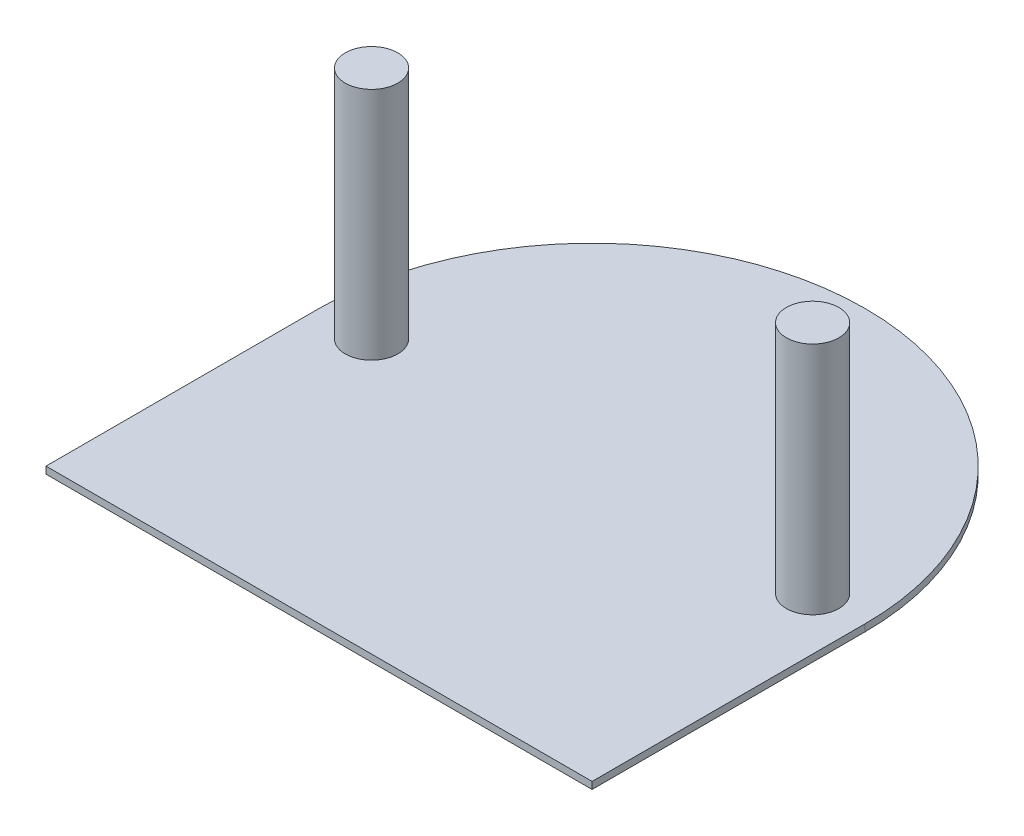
from build123d import *

# Parameters (mm, degrees)
BOSS_EXTRUDE1_DEPTH = 2.54
SKETCH2_R           = 6.35
CUT_EXTRUDE1_DEPTH  = 141.115019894
BOSS_EXTRUDE2_START = 82.55
SKETCH3_R           = 9.525
SKETCH3_R_2         = 6.35
BOSS_EXTRUDE2_DEPTH = 82.55
BOSS_EXTRUDE3_START = 2.54
SKETCH4_R           = 9.525
BOSS_EXTRUDE3_DEPTH = 2.54


with BuildPart() as part:
    # Sketch1 → Boss-Extrude1 (new body)
    with BuildSketch(Plane(origin=(0, 0, 0), x_dir=(1, 0, 0), z_dir=(0, 1, 0))):
        with BuildLine():
            ThreePointArc((99.06, 0), (0, 99.06), (-99.06, 0))
            Line((-99.06, 0), (99.06, 0))
        make_face()
        with BuildLine():
            Line((99.06, 0), (-99.06, 0))
            ThreePointArc((-99.06, 0), (-70.045997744, -70.045997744), (0, -99.06))
            ThreePointArc((0, -99.06), (70.045997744, -70.045997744), (99.06, 0))
        make_face()
        with BuildLine():
            ThreePointArc((99.06, 0), (0, 99.06), (-99.06, 0))
            Line((-99.06, 0), (99.06, 0))
        make_face()
        with BuildLine():
            Line((99.06, 0), (-99.06, 0))
            ThreePointArc((-99.06, 0), (-70.045997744, -70.045997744), (0, -99.06))
            ThreePointArc((0, -99.06), (70.045997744, -70.045997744), (99.06, 0))
        make_face()
        with BuildLine():
            ThreePointArc((0, -99.06), (-70.045997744, -70.045997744), (-99.06, 0))
            Line((-99.06, 0), (-99.06, -99.06))
            Line((-99.06, -99.06), (0, -99.06))
        make_face()
        with BuildLine():
            Line((99.06, -99.06), (99.06, 0))
            ThreePointArc((99.06, 0), (70.045997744, -70.045997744), (0, -99.06))
            Line((0, -99.06), (99.06, -99.06))
        make_face()
    extrude(amount=BOSS_EXTRUDE1_DEPTH)

    # Sketch2 → Cut-Extrude1 (cut, through all)
    with BuildSketch(Plane(origin=(0, 2.54, 0), x_dir=(1, 0, 0), z_dir=(0, 1, 0))):
        with Locations(Location((-80.01, 0, 0), (0, 0, 270))):
            Circle(SKETCH2_R)
        with Locations(Location((80.01, 0, 0), (0, 0, 90))):
            Circle(SKETCH2_R)
    extrude(amount=-CUT_EXTRUDE1_DEPTH, mode=Mode.SUBTRACT)

    # Sketch3 → Boss-Extrude2 (add)
    # profile 1 of 2: a face of its own
    with BuildSketch(Plane(origin=(0, 2.54, 0), x_dir=(1, 0, 0), z_dir=(0, 1, 0)).offset(BOSS_EXTRUDE2_START)):
        with Locations(Location((-80.01, 0, 0), (0, 0, 270))):
            Circle(SKETCH3_R)
        with Locations(Location((-80.01, 0, 0), (0, 0, 270))):
            Circle(SKETCH3_R_2, mode=Mode.SUBTRACT)
    # profile 2 of 2: a face of its own
    with BuildSketch(Plane(origin=(0, 2.54, 0), x_dir=(1, 0, 0), z_dir=(0, 1, 0)).offset(BOSS_EXTRUDE2_START)):
        with Locations(Location((80.01, 0, 0), (0, 0, 270))):
            Circle(SKETCH3_R)
        with Locations(Location((80.01, 0, 0), (0, 0, 270))):
            Circle(SKETCH3_R_2, mode=Mode.SUBTRACT)
    extrude(amount=-BOSS_EXTRUDE2_DEPTH)

    # Sketch4 → Boss-Extrude3 (add)
    with BuildSketch(Plane(origin=(0, 85.09, 0), x_dir=(1, 0, 0), z_dir=(0, 1, 0)).offset(BOSS_EXTRUDE3_START)):
        with Locations(Location((-80.01, 0, 0), (0, 0, 270))):
            Circle(SKETCH4_R)
        with Locations(Location((80.01, 0, 0), (0, 0, 270))):
            Circle(SKETCH4_R)
    extrude(amount=-BOSS_EXTRUDE3_DEPTH)


solid = part.part
